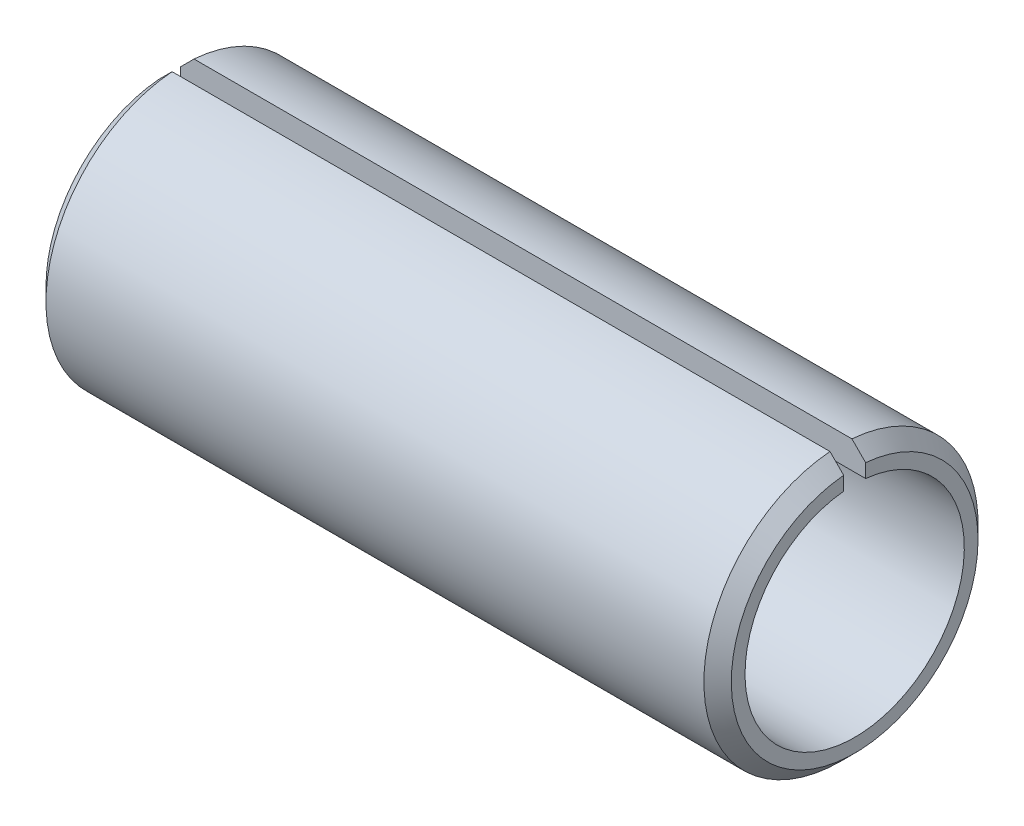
ISO-10303-21;
HEADER;
FILE_DESCRIPTION(('STEP AP214'),'2;1');
FILE_NAME('part.step','',(''),(''),'','','');
FILE_SCHEMA(('AUTOMOTIVE_DESIGN { 1 0 10303 214 1 1 1 1 }'));
ENDSEC;
DATA;
#1=APPLICATION_CONTEXT('core data for automotive mechanical design processes');
#2=APPLICATION_PROTOCOL_DEFINITION('international standard','automotive_design',2000,#1);
#3=PRODUCT_CONTEXT('',#1,'mechanical');
#4=PRODUCT('Part','Part','',(#3));
#5=PRODUCT_RELATED_PRODUCT_CATEGORY('part','',(#4));
#6=PRODUCT_DEFINITION_FORMATION('','',#4);
#7=PRODUCT_DEFINITION_CONTEXT('part definition',#1,'design');
#8=PRODUCT_DEFINITION('design','',#6,#7);
#9=PRODUCT_DEFINITION_SHAPE('','',#8);
#10=(LENGTH_UNIT() NAMED_UNIT(*) SI_UNIT(.MILLI.,.METRE.));
#11=(NAMED_UNIT(*) PLANE_ANGLE_UNIT() SI_UNIT($,.RADIAN.));
#12=(NAMED_UNIT(*) SI_UNIT($,.STERADIAN.) SOLID_ANGLE_UNIT());
#13=UNCERTAINTY_MEASURE_WITH_UNIT(LENGTH_MEASURE(1.E-05),#10,'distance_accuracy_value','');
#14=(GEOMETRIC_REPRESENTATION_CONTEXT(3) GLOBAL_UNCERTAINTY_ASSIGNED_CONTEXT((#13)) GLOBAL_UNIT_ASSIGNED_CONTEXT((#10,
#11,#12)) REPRESENTATION_CONTEXT('',''));
#15=CARTESIAN_POINT('',(0.,0.,0.));
#16=DIRECTION('',(0.,0.,1.));
#17=DIRECTION('',(1.,0.,0.));
#18=AXIS2_PLACEMENT_3D('',#15,#16,#17);
#19=CARTESIAN_POINT('',(0.,0.,0.));
#20=DIRECTION('',(-1.,0.,0.));
#21=DIRECTION('',(0.,0.,0.999999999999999));
#22=AXIS2_PLACEMENT_3D('',#19,#20,#21);
#23=CYLINDRICAL_SURFACE('',#22,1.6);
#24=DIRECTION('',(-1.,0.,0.));
#25=VECTOR('',#24,1.);
#26=CARTESIAN_POINT('',(10.,1.59197989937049,0.159999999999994));
#27=LINE('',#26,#25);
#28=CARTESIAN_POINT('',(10.,1.59197989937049,0.159999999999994));
#29=VERTEX_POINT('',#28);
#30=CARTESIAN_POINT('',(0.,1.5919798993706,0.159999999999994));
#31=VERTEX_POINT('',#30);
#32=EDGE_CURVE('E44',#29,#31,#27,.T.);
#33=ORIENTED_EDGE('',*,*,#32,.F.);
#34=CARTESIAN_POINT('',(10.,0.,0.));
#35=DIRECTION('',(-1.,0.,0.));
#36=DIRECTION('',(0.,0.,0.999999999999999));
#37=AXIS2_PLACEMENT_3D('',#34,#35,#36);
#38=CIRCLE('',#37,1.6);
#39=CARTESIAN_POINT('',(10.,1.59197989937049,-0.16000000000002));
#40=VERTEX_POINT('',#39);
#41=EDGE_CURVE('E86',#40,#29,#38,.T.);
#42=ORIENTED_EDGE('',*,*,#41,.F.);
#43=DIRECTION('',(-1.,0.,0.));
#44=VECTOR('',#43,1.);
#45=CARTESIAN_POINT('',(10.,1.59197989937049,-0.16000000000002));
#46=LINE('',#45,#44);
#47=CARTESIAN_POINT('',(0.,1.5919798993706,-0.159999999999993));
#48=VERTEX_POINT('',#47);
#49=EDGE_CURVE('E80',#40,#48,#46,.T.);
#50=ORIENTED_EDGE('',*,*,#49,.T.);
#51=CARTESIAN_POINT('',(0.,0.,0.));
#52=DIRECTION('',(-1.,0.,0.));
#53=DIRECTION('',(0.,0.,0.999999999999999));
#54=AXIS2_PLACEMENT_3D('',#51,#52,#53);
#55=CIRCLE('',#54,1.6);
#56=EDGE_CURVE('E90',#48,#31,#55,.T.);
#57=ORIENTED_EDGE('',*,*,#56,.T.);
#58=EDGE_LOOP('',(#33,#42,#50,#57));
#59=FACE_BOUND('',#58,.T.);
#60=ADVANCED_FACE('F30',(#59),#23,.F.);
#61=CARTESIAN_POINT('',(10.,1.59999999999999,0.));
#62=DIRECTION('',(-1.,0.,0.));
#63=DIRECTION('',(0.,0.,0.999999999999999));
#64=AXIS2_PLACEMENT_3D('',#61,#62,#63);
#65=PLANE('',#64);
#66=DIRECTION('',(0.,-0.999999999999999,0.));
#67=VECTOR('',#66,1.);
#68=CARTESIAN_POINT('',(9.99999999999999,1.99358972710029,0.159999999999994));
#69=LINE('',#68,#67);
#70=CARTESIAN_POINT('',(10.,1.79287478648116,0.159999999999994));
#71=VERTEX_POINT('',#70);
#72=EDGE_CURVE('E121',#71,#29,#69,.T.);
#73=ORIENTED_EDGE('',*,*,#72,.F.);
#74=CARTESIAN_POINT('',(10.,0.,0.));
#75=DIRECTION('',(-1.,0.,0.));
#76=DIRECTION('',(0.,0.,0.999999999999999));
#77=AXIS2_PLACEMENT_3D('',#74,#75,#76);
#78=CIRCLE('',#77,1.8);
#79=CARTESIAN_POINT('',(10.,1.79287478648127,-0.160000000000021));
#80=VERTEX_POINT('',#79);
#81=EDGE_CURVE('E114',#80,#71,#78,.T.);
#82=ORIENTED_EDGE('',*,*,#81,.F.);
#83=DIRECTION('',(0.,-0.999999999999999,0.));
#84=VECTOR('',#83,1.);
#85=CARTESIAN_POINT('',(10.,1.99358972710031,-0.159999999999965));
#86=LINE('',#85,#84);
#87=EDGE_CURVE('E122',#80,#40,#86,.T.);
#88=ORIENTED_EDGE('',*,*,#87,.T.);
#89=ORIENTED_EDGE('',*,*,#41,.T.);
#90=EDGE_LOOP('',(#73,#82,#88,#89));
#91=FACE_BOUND('',#90,.T.);
#92=ADVANCED_FACE('F119',(#91),#65,.F.);
#93=CARTESIAN_POINT('',(10.,0.,0.));
#94=DIRECTION('',(-1.,0.,0.));
#95=DIRECTION('',(0.,0.,0.999999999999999));
#96=AXIS2_PLACEMENT_3D('',#93,#94,#95);
#97=CONICAL_SURFACE('',#96,1.8,0.785398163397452);
#98=CARTESIAN_POINT('',(9.32069664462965,2.47413522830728,0.159999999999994));
#99=CARTESIAN_POINT('',(9.4256237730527,2.3689867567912,0.159999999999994));
#100=CARTESIAN_POINT('',(9.5305392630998,2.2638266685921,0.159999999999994));
#101=CARTESIAN_POINT('',(9.74032727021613,2.0534637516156,0.159999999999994));
#102=CARTESIAN_POINT('',(9.84519978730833,1.94826092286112,0.159999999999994));
#103=CARTESIAN_POINT('',(10.0548823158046,1.7377928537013,0.159999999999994));
#104=CARTESIAN_POINT('',(10.1596923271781,1.63252761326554,0.159999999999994));
#105=CARTESIAN_POINT('',(10.3691888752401,1.42187423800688,0.159999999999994));
#106=CARTESIAN_POINT('',(10.473875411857,1.31648610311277,0.159999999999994));
#107=CARTESIAN_POINT('',(10.5784696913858,1.21100631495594,0.159999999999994));
#108=B_SPLINE_CURVE_WITH_KNOTS('',3,(#98,#99,#100,#101,#102,#103,#104,#105,#106,#107),
.UNSPECIFIED.,.F.,.F.,(4,2,2,2,4),(0.,0.445637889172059,0.891275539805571,1.33691340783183,
1.78255153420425),.UNSPECIFIED.);
#109=CARTESIAN_POINT('',(9.8,1.99358972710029,0.160000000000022));
#110=VERTEX_POINT('',#109);
#111=EDGE_CURVE('E96',#110,#71,#108,.T.);
#112=ORIENTED_EDGE('',*,*,#111,.F.);
#113=CARTESIAN_POINT('',(9.8,0.,0.));
#114=DIRECTION('',(-1.,0.,0.));
#115=DIRECTION('',(0.,0.,0.999999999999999));
#116=AXIS2_PLACEMENT_3D('',#113,#114,#115);
#117=CIRCLE('',#116,2.);
#118=CARTESIAN_POINT('',(9.8,1.99358972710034,-0.160000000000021));
#119=VERTEX_POINT('',#118);
#120=EDGE_CURVE('E111',#119,#110,#117,.T.);
#121=ORIENTED_EDGE('',*,*,#120,.F.);
#122=CARTESIAN_POINT('',(9.32069664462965,2.47413522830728,-0.160000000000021));
#123=CARTESIAN_POINT('',(9.4256237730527,2.36898675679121,-0.159999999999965));
#124=CARTESIAN_POINT('',(9.5305392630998,2.26382666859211,-0.159999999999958));
#125=CARTESIAN_POINT('',(9.74032727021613,2.05346375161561,-0.159999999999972));
#126=CARTESIAN_POINT('',(9.84519978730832,1.94826092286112,-0.159999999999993));
#127=CARTESIAN_POINT('',(10.0548823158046,1.7377928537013,-0.159999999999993));
#128=CARTESIAN_POINT('',(10.1596923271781,1.63252761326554,-0.159999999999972));
#129=CARTESIAN_POINT('',(10.3691888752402,1.42187423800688,-0.159999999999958));
#130=CARTESIAN_POINT('',(10.473875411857,1.31648610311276,-0.159999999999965));
#131=CARTESIAN_POINT('',(10.5784696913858,1.21100631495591,-0.160000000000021));
#132=B_SPLINE_CURVE_WITH_KNOTS('',3,(#122,#123,#124,#125,#126,#127,#128,#129,#130,#131),
.UNSPECIFIED.,.F.,.F.,(4,2,2,2,4),(0.,0.445637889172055,0.891275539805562,1.33691340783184,
1.78255153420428),.UNSPECIFIED.);
#133=EDGE_CURVE('E138',#119,#80,#132,.T.);
#134=ORIENTED_EDGE('',*,*,#133,.T.);
#135=ORIENTED_EDGE('',*,*,#81,.T.);
#136=EDGE_LOOP('',(#112,#121,#134,#135));
#137=FACE_BOUND('',#136,.T.);
#138=ADVANCED_FACE('F160',(#137),#97,.T.);
#139=CARTESIAN_POINT('',(0.,0.,0.));
#140=DIRECTION('',(-1.,0.,0.));
#141=DIRECTION('',(0.,0.,0.999999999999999));
#142=AXIS2_PLACEMENT_3D('',#139,#140,#141);
#143=CYLINDRICAL_SURFACE('',#142,2.);
#144=DIRECTION('',(-1.,0.,0.));
#145=VECTOR('',#144,1.);
#146=CARTESIAN_POINT('',(9.99999999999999,1.99358972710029,0.159999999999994));
#147=LINE('',#146,#145);
#148=CARTESIAN_POINT('',(0.199999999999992,1.99358972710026,0.159999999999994));
#149=VERTEX_POINT('',#148);
#150=EDGE_CURVE('E129',#110,#149,#147,.T.);
#151=ORIENTED_EDGE('',*,*,#150,.T.);
#152=CARTESIAN_POINT('',(0.199999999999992,0.,0.));
#153=DIRECTION('',(-1.,0.,0.));
#154=DIRECTION('',(0.,0.,0.999999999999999));
#155=AXIS2_PLACEMENT_3D('',#152,#153,#154);
#156=CIRCLE('',#155,2.);
#157=CARTESIAN_POINT('',(0.199999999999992,1.99358972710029,-0.159999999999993));
#158=VERTEX_POINT('',#157);
#159=EDGE_CURVE('E98',#158,#149,#156,.T.);
#160=ORIENTED_EDGE('',*,*,#159,.F.);
#161=DIRECTION('',(-1.,0.,0.));
#162=VECTOR('',#161,1.);
#163=CARTESIAN_POINT('',(10.,1.99358972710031,-0.159999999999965));
#164=LINE('',#163,#162);
#165=EDGE_CURVE('E92',#119,#158,#164,.T.);
#166=ORIENTED_EDGE('',*,*,#165,.F.);
#167=ORIENTED_EDGE('',*,*,#120,.T.);
#168=EDGE_LOOP('',(#151,#160,#166,#167));
#169=FACE_BOUND('',#168,.T.);
#170=ADVANCED_FACE('F164',(#169),#143,.T.);
#171=CARTESIAN_POINT('',(0.199999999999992,0.,0.));
#172=DIRECTION('',(1.,0.,0.));
#173=DIRECTION('',(0.,0.,-0.999999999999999));
#174=AXIS2_PLACEMENT_3D('',#171,#172,#173);
#175=CONICAL_SURFACE('',#174,2.,0.785398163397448);
#176=CARTESIAN_POINT('',(-0.578469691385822,1.21100631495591,0.159999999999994));
#177=CARTESIAN_POINT('',(-0.473875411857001,1.31648610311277,0.159999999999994));
#178=CARTESIAN_POINT('',(-0.369188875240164,1.42187423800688,0.159999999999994));
#179=CARTESIAN_POINT('',(-0.159692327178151,1.63252761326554,0.159999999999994));
#180=CARTESIAN_POINT('',(-0.0548823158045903,1.7377928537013,0.159999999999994));
#181=CARTESIAN_POINT('',(0.154800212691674,1.94826092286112,0.159999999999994));
#182=CARTESIAN_POINT('',(0.259672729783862,2.0534637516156,0.159999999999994));
#183=CARTESIAN_POINT('',(0.469460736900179,2.26382666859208,0.159999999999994));
#184=CARTESIAN_POINT('',(0.574376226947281,2.36898675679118,0.159999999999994));
#185=CARTESIAN_POINT('',(0.679303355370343,2.47413522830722,0.159999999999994));
#186=B_SPLINE_CURVE_WITH_KNOTS('',3,(#176,#177,#178,#179,#180,#181,#182,#183,#184,#185),
.UNSPECIFIED.,.F.,.F.,(4,2,2,2,4),(0.,0.44563812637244,0.891275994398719,1.3369136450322,
1.78255153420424),.UNSPECIFIED.);
#187=CARTESIAN_POINT('',(0.,1.79287478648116,0.159999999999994));
#188=VERTEX_POINT('',#187);
#189=EDGE_CURVE('E100',#188,#149,#186,.T.);
#190=ORIENTED_EDGE('',*,*,#189,.F.);
#191=CARTESIAN_POINT('',(0.,0.,0.));
#192=DIRECTION('',(-1.,0.,0.));
#193=DIRECTION('',(0.,0.,0.999999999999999));
#194=AXIS2_PLACEMENT_3D('',#191,#192,#193);
#195=CIRCLE('',#194,1.8);
#196=CARTESIAN_POINT('',(0.,1.79287478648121,-0.160000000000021));
#197=VERTEX_POINT('',#196);
#198=EDGE_CURVE('E95',#197,#188,#195,.T.);
#199=ORIENTED_EDGE('',*,*,#198,.F.);
#200=CARTESIAN_POINT('',(-0.578469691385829,1.21100631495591,-0.160000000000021));
#201=CARTESIAN_POINT('',(-0.473875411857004,1.31648610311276,-0.159999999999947));
#202=CARTESIAN_POINT('',(-0.369188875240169,1.42187423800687,-0.159999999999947));
#203=CARTESIAN_POINT('',(-0.159692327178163,1.63252761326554,-0.159999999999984));
#204=CARTESIAN_POINT('',(-0.0548823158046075,1.7377928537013,-0.160000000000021));
#205=CARTESIAN_POINT('',(0.154800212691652,1.94826092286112,-0.160000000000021));
#206=CARTESIAN_POINT('',(0.25967272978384,2.05346375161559,-0.159999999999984));
#207=CARTESIAN_POINT('',(0.469460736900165,2.26382666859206,-0.159999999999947));
#208=CARTESIAN_POINT('',(0.574376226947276,2.36898675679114,-0.159999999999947));
#209=CARTESIAN_POINT('',(0.67930335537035,2.47413522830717,-0.160000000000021));
#210=B_SPLINE_CURVE_WITH_KNOTS('',3,(#200,#201,#202,#203,#204,#205,#206,#207,#208,#209),
.UNSPECIFIED.,.F.,.F.,(4,2,2,2,4),(0.,0.445638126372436,0.891275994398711,1.33691364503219,
1.78255153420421),.UNSPECIFIED.);
#211=EDGE_CURVE('E51',#197,#158,#210,.T.);
#212=ORIENTED_EDGE('',*,*,#211,.T.);
#213=ORIENTED_EDGE('',*,*,#159,.T.);
#214=EDGE_LOOP('',(#190,#199,#212,#213));
#215=FACE_BOUND('',#214,.T.);
#216=ADVANCED_FACE('F142',(#215),#175,.T.);
#217=CARTESIAN_POINT('',(0.,1.60000000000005,0.));
#218=DIRECTION('',(-1.,0.,0.));
#219=DIRECTION('',(0.,0.,0.999999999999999));
#220=AXIS2_PLACEMENT_3D('',#217,#218,#219);
#221=PLANE('',#220);
#222=ORIENTED_EDGE('',*,*,#198,.T.);
#223=DIRECTION('',(0.,-0.999999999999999,0.));
#224=VECTOR('',#223,1.);
#225=CARTESIAN_POINT('',(0.,1.59999999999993,0.159999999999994));
#226=LINE('',#225,#224);
#227=EDGE_CURVE('E11',#188,#31,#226,.T.);
#228=ORIENTED_EDGE('',*,*,#227,.T.);
#229=ORIENTED_EDGE('',*,*,#56,.F.);
#230=DIRECTION('',(0.,-0.999999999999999,0.));
#231=VECTOR('',#230,1.);
#232=CARTESIAN_POINT('',(0.,1.59999999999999,-0.160000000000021));
#233=LINE('',#232,#231);
#234=EDGE_CURVE('E37',#197,#48,#233,.T.);
#235=ORIENTED_EDGE('',*,*,#234,.F.);
#236=EDGE_LOOP('',(#222,#228,#229,#235));
#237=FACE_BOUND('',#236,.T.);
#238=ADVANCED_FACE('F94',(#237),#221,.T.);
#239=CARTESIAN_POINT('',(10.,1.99358972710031,-0.159999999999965));
#240=DIRECTION('',(0.,0.,-0.999999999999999));
#241=DIRECTION('',(0.,0.999999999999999,0.));
#242=AXIS2_PLACEMENT_3D('',#239,#240,#241);
#243=PLANE('',#242);
#244=ORIENTED_EDGE('',*,*,#165,.T.);
#245=ORIENTED_EDGE('',*,*,#211,.F.);
#246=ORIENTED_EDGE('',*,*,#234,.T.);
#247=ORIENTED_EDGE('',*,*,#49,.F.);
#248=ORIENTED_EDGE('',*,*,#87,.F.);
#249=ORIENTED_EDGE('',*,*,#133,.F.);
#250=EDGE_LOOP('',(#244,#245,#246,#247,#248,#249));
#251=FACE_BOUND('',#250,.T.);
#252=ADVANCED_FACE('F79',(#251),#243,.F.);
#253=CARTESIAN_POINT('',(9.99999999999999,1.99358972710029,0.159999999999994));
#254=DIRECTION('',(0.,0.,-0.999999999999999));
#255=DIRECTION('',(0.,0.999999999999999,0.));
#256=AXIS2_PLACEMENT_3D('',#253,#254,#255);
#257=PLANE('',#256);
#258=ORIENTED_EDGE('',*,*,#111,.T.);
#259=ORIENTED_EDGE('',*,*,#72,.T.);
#260=ORIENTED_EDGE('',*,*,#32,.T.);
#261=ORIENTED_EDGE('',*,*,#227,.F.);
#262=ORIENTED_EDGE('',*,*,#189,.T.);
#263=ORIENTED_EDGE('',*,*,#150,.F.);
#264=EDGE_LOOP('',(#258,#259,#260,#261,#262,#263));
#265=FACE_BOUND('',#264,.T.);
#266=ADVANCED_FACE('F148',(#265),#257,.T.);
#267=CLOSED_SHELL('',(#60,#92,#138,#170,#216,#238,#252,#266));
#268=MANIFOLD_SOLID_BREP('B2',#267);
#269=ADVANCED_BREP_SHAPE_REPRESENTATION('',(#18,#268),#14);
#270=SHAPE_DEFINITION_REPRESENTATION(#9,#269);
ENDSEC;
END-ISO-10303-21;
